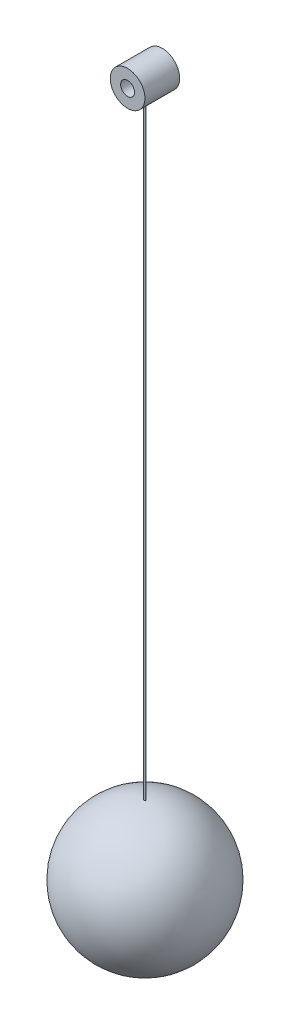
ISO-10303-21;
HEADER;
FILE_DESCRIPTION(('STEP AP214'),'2;1');
FILE_NAME('part.step','',(''),(''),'','','');
FILE_SCHEMA(('AUTOMOTIVE_DESIGN { 1 0 10303 214 1 1 1 1 }'));
ENDSEC;
DATA;
#1=APPLICATION_CONTEXT('core data for automotive mechanical design processes');
#2=APPLICATION_PROTOCOL_DEFINITION('international standard','automotive_design',2000,#1);
#3=PRODUCT_CONTEXT('',#1,'mechanical');
#4=PRODUCT('Part','Part','',(#3));
#5=PRODUCT_RELATED_PRODUCT_CATEGORY('part','',(#4));
#6=PRODUCT_DEFINITION_FORMATION('','',#4);
#7=PRODUCT_DEFINITION_CONTEXT('part definition',#1,'design');
#8=PRODUCT_DEFINITION('design','',#6,#7);
#9=PRODUCT_DEFINITION_SHAPE('','',#8);
#10=(LENGTH_UNIT() NAMED_UNIT(*) SI_UNIT(.MILLI.,.METRE.));
#11=(NAMED_UNIT(*) PLANE_ANGLE_UNIT() SI_UNIT($,.RADIAN.));
#12=(NAMED_UNIT(*) SI_UNIT($,.STERADIAN.) SOLID_ANGLE_UNIT());
#13=UNCERTAINTY_MEASURE_WITH_UNIT(LENGTH_MEASURE(1.E-05),#10,'distance_accuracy_value','');
#14=(GEOMETRIC_REPRESENTATION_CONTEXT(3) GLOBAL_UNCERTAINTY_ASSIGNED_CONTEXT((#13)) GLOBAL_UNIT_ASSIGNED_CONTEXT((#10,
#11,#12)) REPRESENTATION_CONTEXT('',''));
#15=CARTESIAN_POINT('',(0.,0.,0.));
#16=DIRECTION('',(0.,0.,1.));
#17=DIRECTION('',(1.,0.,0.));
#18=AXIS2_PLACEMENT_3D('',#15,#16,#17);
#19=CARTESIAN_POINT('',(0.,0.,0.));
#20=DIRECTION('',(0.,-1.,0.));
#21=DIRECTION('',(1.,0.,0.));
#22=AXIS2_PLACEMENT_3D('',#19,#20,#21);
#23=SPHERICAL_SURFACE('',#22,10.);
#24=CARTESIAN_POINT('',(0.,9.99921871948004,0.));
#25=DIRECTION('',(0.,-1.,0.));
#26=DIRECTION('',(0.,0.,-1.));
#27=AXIS2_PLACEMENT_3D('',#24,#25,#26);
#28=CIRCLE('',#27,0.125000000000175);
#29=CARTESIAN_POINT('',(0.,9.99921871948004,-0.12500000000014));
#30=VERTEX_POINT('',#29);
#31=EDGE_CURVE('E42',#30,#30,#28,.F.);
#32=ORIENTED_EDGE('',*,*,#31,.F.);
#33=EDGE_LOOP('',(#32));
#34=FACE_BOUND('',#33,.T.);
#35=ADVANCED_FACE('F33',(#34),#23,.T.);
#36=CARTESIAN_POINT('',(0.,0.,0.));
#37=DIRECTION('',(0.,-1.,0.));
#38=DIRECTION('',(0.,0.,-1.));
#39=AXIS2_PLACEMENT_3D('',#36,#37,#38);
#40=CYLINDRICAL_SURFACE('',#39,0.125000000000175);
#41=CARTESIAN_POINT('',(0.,97.5,-0.124999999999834));
#42=CARTESIAN_POINT('',(-0.00701660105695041,97.5000000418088,-0.124999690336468));
#43=CARTESIAN_POINT('',(-0.0140381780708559,97.500029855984,-0.124407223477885));
#44=CARTESIAN_POINT('',(-0.02788763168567,97.500145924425,-0.122052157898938));
#45=CARTESIAN_POINT('',(-0.0347152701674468,97.5002322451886,-0.120288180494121));
#46=CARTESIAN_POINT('',(-0.0479742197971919,97.5004515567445,-0.11564072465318));
#47=CARTESIAN_POINT('',(-0.0544057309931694,97.5005845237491,-0.112757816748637));
#48=CARTESIAN_POINT('',(-0.0666917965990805,97.5008821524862,-0.105955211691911));
#49=CARTESIAN_POINT('',(-0.0725464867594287,97.5010468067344,-0.102035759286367));
#50=CARTESIAN_POINT('',(-0.0835203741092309,97.5013894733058,-0.0932669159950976));
#51=CARTESIAN_POINT('',(-0.0886389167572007,97.5015674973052,-0.0884167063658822));
#52=CARTESIAN_POINT('',(-0.0979896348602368,97.501916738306,-0.0779256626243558));
#53=CARTESIAN_POINT('',(-0.102221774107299,97.5020879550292,-0.0722847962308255));
#54=CARTESIAN_POINT('',(-0.109681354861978,97.5024043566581,-0.0603691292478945));
#55=CARTESIAN_POINT('',(-0.112908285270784,97.5025495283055,-0.0540940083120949));
#56=CARTESIAN_POINT('',(-0.118262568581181,97.5027973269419,-0.041090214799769));
#57=CARTESIAN_POINT('',(-0.12038992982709,97.5028999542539,-0.0343615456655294));
#58=CARTESIAN_POINT('',(-0.123482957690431,97.5030509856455,-0.0206476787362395));
#59=CARTESIAN_POINT('',(-0.124449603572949,97.5030994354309,-0.0136627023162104));
#60=CARTESIAN_POINT('',(-0.125196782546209,97.5031367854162,0.000370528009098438));
#61=CARTESIAN_POINT('',(-0.12497732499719,97.503125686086,0.00741878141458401));
#62=CARTESIAN_POINT('',(-0.123359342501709,97.5030452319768,0.021371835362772));
#63=CARTESIAN_POINT('',(-0.121961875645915,97.5029759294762,0.0282767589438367));
#64=CARTESIAN_POINT('',(-0.118029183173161,97.5027869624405,0.041753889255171));
#65=CARTESIAN_POINT('',(-0.115493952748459,97.5026672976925,0.0483260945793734));
#66=CARTESIAN_POINT('',(-0.109356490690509,97.5023910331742,0.0609546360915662));
#67=CARTESIAN_POINT('',(-0.105753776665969,97.5022344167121,0.0670107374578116));
#68=CARTESIAN_POINT('',(-0.0975839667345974,97.5019019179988,0.0784325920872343));
#69=CARTESIAN_POINT('',(-0.0930168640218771,97.5017260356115,0.0837983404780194));
#70=CARTESIAN_POINT('',(-0.0830419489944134,97.5013745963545,0.0936933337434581));
#71=CARTESIAN_POINT('',(-0.0776332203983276,97.5011990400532,0.0982216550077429));
#72=CARTESIAN_POINT('',(-0.0661318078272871,97.5008682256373,0.106306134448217));
#73=CARTESIAN_POINT('',(-0.0600391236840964,97.5007129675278,0.109862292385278));
#74=CARTESIAN_POINT('',(-0.0473422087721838,97.5004402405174,0.115901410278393));
#75=CARTESIAN_POINT('',(-0.0407379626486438,97.5003227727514,0.118384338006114));
#76=CARTESIAN_POINT('',(-0.0272056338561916,97.5001388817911,0.122205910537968));
#77=CARTESIAN_POINT('',(-0.0202775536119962,97.5000724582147,0.123544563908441));
#78=CARTESIAN_POINT('',(-0.00630223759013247,97.4999981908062,0.125038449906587));
#79=CARTESIAN_POINT('',(0.000744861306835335,97.4999902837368,0.125194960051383));
#80=CARTESIAN_POINT('',(0.0147652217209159,97.5000337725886,0.124323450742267));
#81=CARTESIAN_POINT('',(0.0217384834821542,97.5000851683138,0.123295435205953));
#82=CARTESIAN_POINT('',(0.035409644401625,97.5002414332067,0.12008511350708));
#83=CARTESIAN_POINT('',(0.0421076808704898,97.5003462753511,0.117903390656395));
#84=CARTESIAN_POINT('',(0.0550424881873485,97.5005976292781,0.112448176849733));
#85=CARTESIAN_POINT('',(0.0612792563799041,97.5007441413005,0.109174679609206));
#86=CARTESIAN_POINT('',(0.0731203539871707,97.5010625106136,0.101625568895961));
#87=CARTESIAN_POINT('',(0.0787241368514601,97.5012343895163,0.0973490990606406));
#88=CARTESIAN_POINT('',(0.0891346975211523,97.5015840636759,0.0879166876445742));
#89=CARTESIAN_POINT('',(0.0939414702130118,97.5017618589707,0.0827607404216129));
#90=CARTESIAN_POINT('',(0.102625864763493,97.5021035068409,0.0717102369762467));
#91=CARTESIAN_POINT('',(0.106502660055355,97.5022673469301,0.0658150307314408));
#92=CARTESIAN_POINT('',(0.113211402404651,97.5025624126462,0.0534566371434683));
#93=CARTESIAN_POINT('',(0.116043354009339,97.502693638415,0.0469934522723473));
#94=CARTESIAN_POINT('',(0.120580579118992,97.5029085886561,0.0336856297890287));
#95=CARTESIAN_POINT('',(0.122286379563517,97.5029923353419,0.0268411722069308));
#96=CARTESIAN_POINT('',(0.124524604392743,97.5031029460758,0.0129625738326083));
#97=CARTESIAN_POINT('',(0.125057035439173,97.5031298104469,0.00592843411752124));
#98=CARTESIAN_POINT('',(0.124933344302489,97.5031236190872,-0.00812162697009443));
#99=CARTESIAN_POINT('',(0.124278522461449,97.5030906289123,-0.0151375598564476));
#100=CARTESIAN_POINT('',(0.121801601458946,97.5029685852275,-0.0289597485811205));
#101=CARTESIAN_POINT('',(0.119979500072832,97.5028795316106,-0.0357660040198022));
#102=CARTESIAN_POINT('',(0.115220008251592,97.502655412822,-0.0489759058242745));
#103=CARTESIAN_POINT('',(0.112282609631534,97.5025203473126,-0.055379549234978));
#104=CARTESIAN_POINT('',(0.105376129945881,97.5022194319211,-0.0676028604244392));
#105=CARTESIAN_POINT('',(0.101407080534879,97.5020535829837,-0.0734225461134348));
#106=CARTESIAN_POINT('',(0.0925453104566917,97.5017095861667,-0.0843192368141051));
#107=CARTESIAN_POINT('',(0.0876516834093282,97.5015314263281,-0.089395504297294));
#108=CARTESIAN_POINT('',(0.077080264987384,97.5011829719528,-0.0986560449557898));
#109=CARTESIAN_POINT('',(0.0714022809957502,97.5010126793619,-0.102840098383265));
#110=CARTESIAN_POINT('',(0.059418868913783,97.5006990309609,-0.110199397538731));
#111=CARTESIAN_POINT('',(0.0531128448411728,97.500555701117,-0.113373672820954));
#112=CARTESIAN_POINT('',(0.0400613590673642,97.5003125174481,-0.118614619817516));
#113=CARTESIAN_POINT('',(0.0333164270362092,97.5002126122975,-0.120682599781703));
#114=CARTESIAN_POINT('',(0.0221079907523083,97.5000939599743,-0.123109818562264));
#115=CARTESIAN_POINT('',(0.0177170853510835,97.5000588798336,-0.123817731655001));
#116=CARTESIAN_POINT('',(0.00888478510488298,97.5000118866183,-0.124762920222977));
#117=CARTESIAN_POINT('',(0.00444339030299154,97.4999999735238,-0.125000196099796));
#118=CARTESIAN_POINT('',(0.,97.5,-0.124999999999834));
#119=B_SPLINE_CURVE_WITH_KNOTS('',3,(#41,#42,#43,#44,#45,#46,#47,#48,#49,#50,#51,#52,#53,#54,
#55,#56,#57,#58,#59,#60,#61,#62,#63,#64,#65,#66,#67,#68,#69,#70,#71,#72,#73,#74,#75,#76,#77,#78,
#79,#80,#81,#82,#83,#84,#85,#86,#87,#88,#89,#90,#91,#92,#93,#94,#95,#96,#97,#98,#99,#100,#101,
#102,#103,#104,#105,#106,#107,#108,#109,#110,#111,#112,#113,#114,#115,#116,#117,#118),
.UNSPECIFIED.,.T.,.F.,(4,2,2,2,2,2,2,2,2,2,2,2,2,2,2,2,2,2,2,2,2,2,2,2,2,2,2,2,2,2,2,2,2,2,2,2,
2,2,4),(0.,0.0210335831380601,0.0420919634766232,0.0631396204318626,0.084182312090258,
0.105243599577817,0.126305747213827,0.147378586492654,0.16845126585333,0.189506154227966,
0.21056087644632,0.231596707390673,0.252632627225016,0.273678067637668,0.294723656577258,
0.315792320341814,0.336860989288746,0.357930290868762,0.378999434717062,0.400045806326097,
0.421092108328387,0.442127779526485,0.46316357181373,0.4842173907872,0.505271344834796,
0.5263439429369,0.547416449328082,0.568479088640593,0.589541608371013,0.61058107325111,
0.631620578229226,0.652660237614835,0.673699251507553,0.694758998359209,0.715823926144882,
0.736909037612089,0.757969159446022,0.771289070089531,0.784608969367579),.UNSPECIFIED.);
#120=CARTESIAN_POINT('',(0.,97.5,-0.124999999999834));
#121=VERTEX_POINT('',#120);
#122=EDGE_CURVE('E10',#121,#121,#119,.T.);
#123=ORIENTED_EDGE('',*,*,#122,.F.);
#124=EDGE_LOOP('',(#123));
#125=FACE_BOUND('',#124,.T.);
#126=ORIENTED_EDGE('',*,*,#31,.T.);
#127=EDGE_LOOP('',(#126));
#128=FACE_BOUND('',#127,.T.);
#129=ADVANCED_FACE('F74',(#125,#128),#40,.T.);
#130=CARTESIAN_POINT('',(0.,100.,-2.5));
#131=DIRECTION('',(0.,0.,1.));
#132=DIRECTION('',(1.,0.,0.));
#133=AXIS2_PLACEMENT_3D('',#130,#131,#132);
#134=CYLINDRICAL_SURFACE('',#133,2.5);
#135=ORIENTED_EDGE('',*,*,#122,.T.);
#136=EDGE_LOOP('',(#135));
#137=FACE_BOUND('',#136,.T.);
#138=CARTESIAN_POINT('',(0.,100.,-2.5));
#139=DIRECTION('',(0.,0.,1.));
#140=DIRECTION('',(1.,0.,0.));
#141=AXIS2_PLACEMENT_3D('',#138,#139,#140);
#142=CIRCLE('',#141,2.5);
#143=CARTESIAN_POINT('',(2.5,100.,-2.5));
#144=VERTEX_POINT('',#143);
#145=EDGE_CURVE('E46',#144,#144,#142,.T.);
#146=ORIENTED_EDGE('',*,*,#145,.T.);
#147=EDGE_LOOP('',(#146));
#148=FACE_BOUND('',#147,.T.);
#149=CARTESIAN_POINT('',(0.,100.,2.5));
#150=DIRECTION('',(0.,0.,1.));
#151=DIRECTION('',(1.,0.,0.));
#152=AXIS2_PLACEMENT_3D('',#149,#150,#151);
#153=CIRCLE('',#152,2.5);
#154=CARTESIAN_POINT('',(2.5,100.,2.5));
#155=VERTEX_POINT('',#154);
#156=EDGE_CURVE('E50',#155,#155,#153,.T.);
#157=ORIENTED_EDGE('',*,*,#156,.F.);
#158=EDGE_LOOP('',(#157));
#159=FACE_BOUND('',#158,.T.);
#160=ADVANCED_FACE('F72',(#137,#148,#159),#134,.T.);
#161=CARTESIAN_POINT('',(0.,100.,-2.5));
#162=DIRECTION('',(0.,0.,1.));
#163=DIRECTION('',(1.,0.,0.));
#164=AXIS2_PLACEMENT_3D('',#161,#162,#163);
#165=PLANE('',#164);
#166=CARTESIAN_POINT('',(0.,100.,-2.5));
#167=DIRECTION('',(0.,0.,1.));
#168=DIRECTION('',(1.,0.,0.));
#169=AXIS2_PLACEMENT_3D('',#166,#167,#168);
#170=CIRCLE('',#169,1.);
#171=CARTESIAN_POINT('',(1.,100.,-2.5));
#172=VERTEX_POINT('',#171);
#173=EDGE_CURVE('E55',#172,#172,#170,.T.);
#174=ORIENTED_EDGE('',*,*,#173,.T.);
#175=EDGE_LOOP('',(#174));
#176=FACE_BOUND('',#175,.T.);
#177=ORIENTED_EDGE('',*,*,#145,.F.);
#178=EDGE_LOOP('',(#177));
#179=FACE_BOUND('',#178,.T.);
#180=ADVANCED_FACE('F68',(#176,#179),#165,.F.);
#181=CARTESIAN_POINT('',(0.,100.,2.5));
#182=DIRECTION('',(0.,0.,1.));
#183=DIRECTION('',(1.,0.,0.));
#184=AXIS2_PLACEMENT_3D('',#181,#182,#183);
#185=PLANE('',#184);
#186=CARTESIAN_POINT('',(0.,100.,2.5));
#187=DIRECTION('',(0.,0.,1.));
#188=DIRECTION('',(1.,0.,0.));
#189=AXIS2_PLACEMENT_3D('',#186,#187,#188);
#190=CIRCLE('',#189,1.);
#191=CARTESIAN_POINT('',(1.,100.,2.5));
#192=VERTEX_POINT('',#191);
#193=EDGE_CURVE('E58',#192,#192,#190,.T.);
#194=ORIENTED_EDGE('',*,*,#193,.F.);
#195=EDGE_LOOP('',(#194));
#196=FACE_BOUND('',#195,.T.);
#197=ORIENTED_EDGE('',*,*,#156,.T.);
#198=EDGE_LOOP('',(#197));
#199=FACE_BOUND('',#198,.T.);
#200=ADVANCED_FACE('F65',(#196,#199),#185,.T.);
#201=CARTESIAN_POINT('',(0.,100.,-10.));
#202=DIRECTION('',(0.,0.,1.));
#203=DIRECTION('',(1.,0.,0.));
#204=AXIS2_PLACEMENT_3D('',#201,#202,#203);
#205=CYLINDRICAL_SURFACE('',#204,1.);
#206=ORIENTED_EDGE('',*,*,#193,.T.);
#207=EDGE_LOOP('',(#206));
#208=FACE_BOUND('',#207,.T.);
#209=ORIENTED_EDGE('',*,*,#173,.F.);
#210=EDGE_LOOP('',(#209));
#211=FACE_BOUND('',#210,.T.);
#212=ADVANCED_FACE('F62',(#208,#211),#205,.F.);
#213=CLOSED_SHELL('',(#35,#129,#160,#180,#200,#212));
#214=MANIFOLD_SOLID_BREP('B2',#213);
#215=ADVANCED_BREP_SHAPE_REPRESENTATION('',(#18,#214),#14);
#216=SHAPE_DEFINITION_REPRESENTATION(#9,#215);
ENDSEC;
END-ISO-10303-21;
